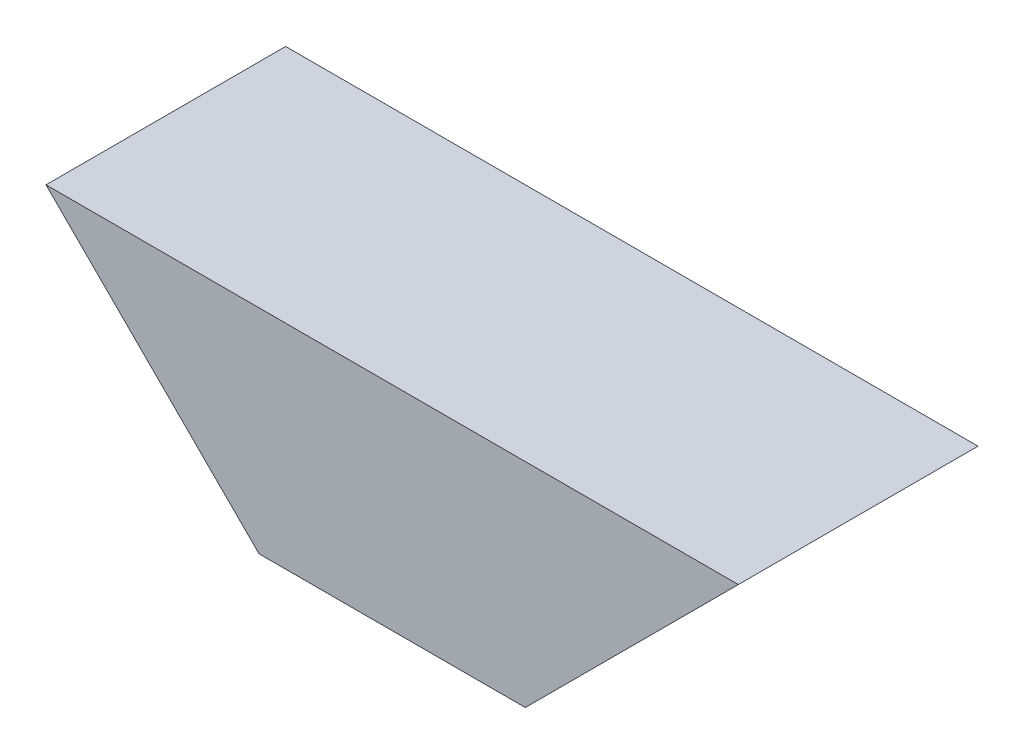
ISO-10303-21;
HEADER;
FILE_DESCRIPTION(('STEP AP214'),'2;1');
FILE_NAME('part.step','',(''),(''),'','','');
FILE_SCHEMA(('AUTOMOTIVE_DESIGN { 1 0 10303 214 1 1 1 1 }'));
ENDSEC;
DATA;
#1=APPLICATION_CONTEXT('core data for automotive mechanical design processes');
#2=APPLICATION_PROTOCOL_DEFINITION('international standard','automotive_design',2000,#1);
#3=PRODUCT_CONTEXT('',#1,'mechanical');
#4=PRODUCT('Part','Part','',(#3));
#5=PRODUCT_RELATED_PRODUCT_CATEGORY('part','',(#4));
#6=PRODUCT_DEFINITION_FORMATION('','',#4);
#7=PRODUCT_DEFINITION_CONTEXT('part definition',#1,'design');
#8=PRODUCT_DEFINITION('design','',#6,#7);
#9=PRODUCT_DEFINITION_SHAPE('','',#8);
#10=(LENGTH_UNIT() NAMED_UNIT(*) SI_UNIT(.MILLI.,.METRE.));
#11=(NAMED_UNIT(*) PLANE_ANGLE_UNIT() SI_UNIT($,.RADIAN.));
#12=(NAMED_UNIT(*) SI_UNIT($,.STERADIAN.) SOLID_ANGLE_UNIT());
#13=UNCERTAINTY_MEASURE_WITH_UNIT(LENGTH_MEASURE(1.E-05),#10,'distance_accuracy_value','');
#14=(GEOMETRIC_REPRESENTATION_CONTEXT(3) GLOBAL_UNCERTAINTY_ASSIGNED_CONTEXT((#13)) GLOBAL_UNIT_ASSIGNED_CONTEXT((#10,
#11,#12)) REPRESENTATION_CONTEXT('',''));
#15=CARTESIAN_POINT('',(0.,0.,0.));
#16=DIRECTION('',(0.,0.,1.));
#17=DIRECTION('',(1.,0.,0.));
#18=AXIS2_PLACEMENT_3D('',#15,#16,#17);
#19=CARTESIAN_POINT('',(-50.,0.,90.));
#20=DIRECTION('',(0.707106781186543,0.707106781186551,0.));
#21=DIRECTION('',(-0.707106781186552,0.707106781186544,0.));
#22=AXIS2_PLACEMENT_3D('',#19,#20,#21);
#23=PLANE('',#22);
#24=DIRECTION('',(0.707106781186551,-0.707106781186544,0.));
#25=VECTOR('',#24,1.);
#26=CARTESIAN_POINT('',(-50.,0.,0.));
#27=LINE('',#26,#25);
#28=CARTESIAN_POINT('',(-130.000000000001,80.,0.));
#29=VERTEX_POINT('',#28);
#30=CARTESIAN_POINT('',(-50.,0.,0.));
#31=VERTEX_POINT('',#30);
#32=EDGE_CURVE('E100',#29,#31,#27,.T.);
#33=ORIENTED_EDGE('',*,*,#32,.T.);
#34=DIRECTION('',(0.,0.,-1.));
#35=VECTOR('',#34,1.);
#36=CARTESIAN_POINT('',(-50.,0.,90.));
#37=LINE('',#36,#35);
#38=CARTESIAN_POINT('',(-50.,0.,90.));
#39=VERTEX_POINT('',#38);
#40=EDGE_CURVE('E11',#39,#31,#37,.T.);
#41=ORIENTED_EDGE('',*,*,#40,.F.);
#42=DIRECTION('',(0.707106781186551,-0.707106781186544,0.));
#43=VECTOR('',#42,1.);
#44=CARTESIAN_POINT('',(-50.,0.,90.));
#45=LINE('',#44,#43);
#46=CARTESIAN_POINT('',(-130.000000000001,80.,90.));
#47=VERTEX_POINT('',#46);
#48=EDGE_CURVE('E88',#47,#39,#45,.T.);
#49=ORIENTED_EDGE('',*,*,#48,.F.);
#50=DIRECTION('',(0.,0.,-1.));
#51=VECTOR('',#50,1.);
#52=CARTESIAN_POINT('',(-130.000000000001,80.,90.));
#53=LINE('',#52,#51);
#54=EDGE_CURVE('E96',#47,#29,#53,.T.);
#55=ORIENTED_EDGE('',*,*,#54,.T.);
#56=EDGE_LOOP('',(#33,#41,#49,#55));
#57=FACE_BOUND('',#56,.T.);
#58=ADVANCED_FACE('F37',(#57),#23,.F.);
#59=CARTESIAN_POINT('',(-50.,0.,90.));
#60=DIRECTION('',(0.,1.,0.));
#61=DIRECTION('',(-1.,0.,0.));
#62=AXIS2_PLACEMENT_3D('',#59,#60,#61);
#63=PLANE('',#62);
#64=DIRECTION('',(1.,0.,0.));
#65=VECTOR('',#64,1.);
#66=CARTESIAN_POINT('',(-50.,0.,0.));
#67=LINE('',#66,#65);
#68=CARTESIAN_POINT('',(50.,0.,0.));
#69=VERTEX_POINT('',#68);
#70=EDGE_CURVE('E92',#31,#69,#67,.T.);
#71=ORIENTED_EDGE('',*,*,#70,.T.);
#72=DIRECTION('',(0.,0.,-1.));
#73=VECTOR('',#72,1.);
#74=CARTESIAN_POINT('',(50.,0.,90.));
#75=LINE('',#74,#73);
#76=CARTESIAN_POINT('',(50.,0.,90.));
#77=VERTEX_POINT('',#76);
#78=EDGE_CURVE('E45',#77,#69,#75,.T.);
#79=ORIENTED_EDGE('',*,*,#78,.F.);
#80=DIRECTION('',(1.,0.,0.));
#81=VECTOR('',#80,1.);
#82=CARTESIAN_POINT('',(-50.,0.,90.));
#83=LINE('',#82,#81);
#84=EDGE_CURVE('E83',#39,#77,#83,.T.);
#85=ORIENTED_EDGE('',*,*,#84,.F.);
#86=ORIENTED_EDGE('',*,*,#40,.T.);
#87=EDGE_LOOP('',(#71,#79,#85,#86));
#88=FACE_BOUND('',#87,.T.);
#89=ADVANCED_FACE('F91',(#88),#63,.F.);
#90=CARTESIAN_POINT('',(130.000000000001,80.,90.));
#91=DIRECTION('',(-0.707106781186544,0.707106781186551,0.));
#92=DIRECTION('',(-0.707106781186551,-0.707106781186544,0.));
#93=AXIS2_PLACEMENT_3D('',#90,#91,#92);
#94=PLANE('',#93);
#95=DIRECTION('',(0.707106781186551,0.707106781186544,0.));
#96=VECTOR('',#95,1.);
#97=CARTESIAN_POINT('',(130.000000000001,80.,0.));
#98=LINE('',#97,#96);
#99=CARTESIAN_POINT('',(130.000000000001,80.,0.));
#100=VERTEX_POINT('',#99);
#101=EDGE_CURVE('E70',#69,#100,#98,.T.);
#102=ORIENTED_EDGE('',*,*,#101,.T.);
#103=DIRECTION('',(0.,0.,-1.));
#104=VECTOR('',#103,1.);
#105=CARTESIAN_POINT('',(130.000000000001,80.,90.));
#106=LINE('',#105,#104);
#107=CARTESIAN_POINT('',(130.000000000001,80.,90.));
#108=VERTEX_POINT('',#107);
#109=EDGE_CURVE('E93',#108,#100,#106,.T.);
#110=ORIENTED_EDGE('',*,*,#109,.F.);
#111=DIRECTION('',(0.707106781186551,0.707106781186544,0.));
#112=VECTOR('',#111,1.);
#113=CARTESIAN_POINT('',(130.000000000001,80.,90.));
#114=LINE('',#113,#112);
#115=EDGE_CURVE('E86',#77,#108,#114,.T.);
#116=ORIENTED_EDGE('',*,*,#115,.F.);
#117=ORIENTED_EDGE('',*,*,#78,.T.);
#118=EDGE_LOOP('',(#102,#110,#116,#117));
#119=FACE_BOUND('',#118,.T.);
#120=ADVANCED_FACE('F94',(#119),#94,.F.);
#121=CARTESIAN_POINT('',(-130.000000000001,80.,90.));
#122=DIRECTION('',(0.,-1.,0.));
#123=DIRECTION('',(0.,0.,-1.));
#124=AXIS2_PLACEMENT_3D('',#121,#122,#123);
#125=PLANE('',#124);
#126=DIRECTION('',(-1.,0.,0.));
#127=VECTOR('',#126,1.);
#128=CARTESIAN_POINT('',(-130.000000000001,80.,0.));
#129=LINE('',#128,#127);
#130=EDGE_CURVE('E76',#100,#29,#129,.T.);
#131=ORIENTED_EDGE('',*,*,#130,.T.);
#132=ORIENTED_EDGE('',*,*,#54,.F.);
#133=DIRECTION('',(-1.,0.,0.));
#134=VECTOR('',#133,1.);
#135=CARTESIAN_POINT('',(-130.000000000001,80.,90.));
#136=LINE('',#135,#134);
#137=EDGE_CURVE('E53',#108,#47,#136,.T.);
#138=ORIENTED_EDGE('',*,*,#137,.F.);
#139=ORIENTED_EDGE('',*,*,#109,.T.);
#140=EDGE_LOOP('',(#131,#132,#138,#139));
#141=FACE_BOUND('',#140,.T.);
#142=ADVANCED_FACE('F107',(#141),#125,.F.);
#143=CARTESIAN_POINT('',(0.,0.,90.));
#144=DIRECTION('',(0.,0.,1.));
#145=DIRECTION('',(1.,0.,0.));
#146=AXIS2_PLACEMENT_3D('',#143,#144,#145);
#147=PLANE('',#146);
#148=ORIENTED_EDGE('',*,*,#48,.T.);
#149=ORIENTED_EDGE('',*,*,#84,.T.);
#150=ORIENTED_EDGE('',*,*,#115,.T.);
#151=ORIENTED_EDGE('',*,*,#137,.T.);
#152=EDGE_LOOP('',(#148,#149,#150,#151));
#153=FACE_BOUND('',#152,.T.);
#154=ADVANCED_FACE('F84',(#153),#147,.T.);
#155=CARTESIAN_POINT('',(0.,0.,0.));
#156=DIRECTION('',(0.,0.,1.));
#157=DIRECTION('',(1.,0.,0.));
#158=AXIS2_PLACEMENT_3D('',#155,#156,#157);
#159=PLANE('',#158);
#160=ORIENTED_EDGE('',*,*,#32,.F.);
#161=ORIENTED_EDGE('',*,*,#130,.F.);
#162=ORIENTED_EDGE('',*,*,#101,.F.);
#163=ORIENTED_EDGE('',*,*,#70,.F.);
#164=EDGE_LOOP('',(#160,#161,#162,#163));
#165=FACE_BOUND('',#164,.T.);
#166=ADVANCED_FACE('F110',(#165),#159,.F.);
#167=CLOSED_SHELL('',(#58,#89,#120,#142,#154,#166));
#168=MANIFOLD_SOLID_BREP('B2',#167);
#169=ADVANCED_BREP_SHAPE_REPRESENTATION('',(#18,#168),#14);
#170=SHAPE_DEFINITION_REPRESENTATION(#9,#169);
ENDSEC;
END-ISO-10303-21;
